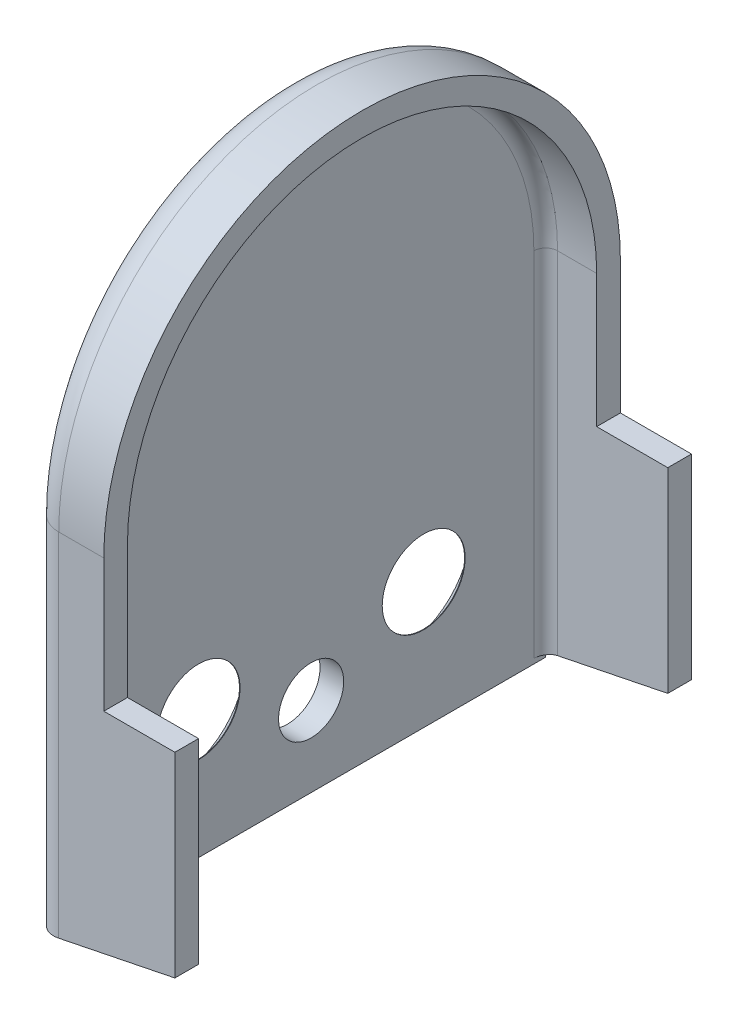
ISO-10303-21;
HEADER;
FILE_DESCRIPTION(('STEP AP214'),'2;1');
FILE_NAME('part.step','',(''),(''),'','','');
FILE_SCHEMA(('AUTOMOTIVE_DESIGN { 1 0 10303 214 1 1 1 1 }'));
ENDSEC;
DATA;
#1=APPLICATION_CONTEXT('core data for automotive mechanical design processes');
#2=APPLICATION_PROTOCOL_DEFINITION('international standard','automotive_design',2000,#1);
#3=PRODUCT_CONTEXT('',#1,'mechanical');
#4=PRODUCT('Part','Part','',(#3));
#5=PRODUCT_RELATED_PRODUCT_CATEGORY('part','',(#4));
#6=PRODUCT_DEFINITION_FORMATION('','',#4);
#7=PRODUCT_DEFINITION_CONTEXT('part definition',#1,'design');
#8=PRODUCT_DEFINITION('design','',#6,#7);
#9=PRODUCT_DEFINITION_SHAPE('','',#8);
#10=(LENGTH_UNIT() NAMED_UNIT(*) SI_UNIT(.MILLI.,.METRE.));
#11=(NAMED_UNIT(*) PLANE_ANGLE_UNIT() SI_UNIT($,.RADIAN.));
#12=(NAMED_UNIT(*) SI_UNIT($,.STERADIAN.) SOLID_ANGLE_UNIT());
#13=UNCERTAINTY_MEASURE_WITH_UNIT(LENGTH_MEASURE(1.E-05),#10,'distance_accuracy_value','');
#14=(GEOMETRIC_REPRESENTATION_CONTEXT(3) GLOBAL_UNCERTAINTY_ASSIGNED_CONTEXT((#13)) GLOBAL_UNIT_ASSIGNED_CONTEXT((#10,
#11,#12)) REPRESENTATION_CONTEXT('',''));
#15=CARTESIAN_POINT('',(0.,0.,0.));
#16=DIRECTION('',(0.,0.,1.));
#17=DIRECTION('',(1.,0.,0.));
#18=AXIS2_PLACEMENT_3D('',#15,#16,#17);
#19=CARTESIAN_POINT('',(-2.,-26.,21.8));
#20=DIRECTION('',(0.,-1.,0.));
#21=DIRECTION('',(0.,0.,-1.));
#22=AXIS2_PLACEMENT_3D('',#19,#20,#21);
#23=PLANE('',#22);
#24=DIRECTION('',(0.,0.,-1.));
#25=VECTOR('',#24,1.);
#26=CARTESIAN_POINT('',(-2.,-26.,21.8));
#27=LINE('',#26,#25);
#28=CARTESIAN_POINT('',(-2.,-26.,19.3));
#29=VERTEX_POINT('',#28);
#30=CARTESIAN_POINT('',(-2.,-26.,-19.3));
#31=VERTEX_POINT('',#30);
#32=EDGE_CURVE('E247',#29,#31,#27,.T.);
#33=ORIENTED_EDGE('',*,*,#32,.T.);
#34=CARTESIAN_POINT('',(0.5,-26.,-19.3));
#35=DIRECTION('',(0.,-1.,0.));
#36=DIRECTION('',(0.,0.,-1.));
#37=AXIS2_PLACEMENT_3D('',#34,#35,#36);
#38=CIRCLE('',#37,2.5);
#39=CARTESIAN_POINT('',(-1.94948974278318,-26.,-19.8));
#40=VERTEX_POINT('',#39);
#41=EDGE_CURVE('E428',#31,#40,#38,.T.);
#42=ORIENTED_EDGE('',*,*,#41,.T.);
#43=DIRECTION('',(1.,0.,0.));
#44=VECTOR('',#43,1.);
#45=CARTESIAN_POINT('',(10.3,-26.,-19.8));
#46=LINE('',#45,#44);
#47=CARTESIAN_POINT('',(0.,-26.,-19.8));
#48=VERTEX_POINT('',#47);
#49=EDGE_CURVE('E254',#40,#48,#46,.T.);
#50=ORIENTED_EDGE('',*,*,#49,.T.);
#51=DIRECTION('',(0.,0.,-1.));
#52=VECTOR('',#51,1.);
#53=CARTESIAN_POINT('',(0.,-26.,21.8));
#54=LINE('',#53,#52);
#55=CARTESIAN_POINT('',(0.,-26.,19.8));
#56=VERTEX_POINT('',#55);
#57=EDGE_CURVE('E307',#56,#48,#54,.T.);
#58=ORIENTED_EDGE('',*,*,#57,.F.);
#59=DIRECTION('',(1.,0.,0.));
#60=VECTOR('',#59,1.);
#61=CARTESIAN_POINT('',(10.3,-26.,19.8));
#62=LINE('',#61,#60);
#63=CARTESIAN_POINT('',(-1.94948974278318,-26.,19.8));
#64=VERTEX_POINT('',#63);
#65=EDGE_CURVE('E257',#64,#56,#62,.T.);
#66=ORIENTED_EDGE('',*,*,#65,.F.);
#67=CARTESIAN_POINT('',(0.5,-26.,19.3));
#68=DIRECTION('',(0.,-1.,0.));
#69=DIRECTION('',(0.,0.,-1.));
#70=AXIS2_PLACEMENT_3D('',#67,#68,#69);
#71=CIRCLE('',#70,2.5);
#72=EDGE_CURVE('E253',#64,#29,#71,.T.);
#73=ORIENTED_EDGE('',*,*,#72,.T.);
#74=EDGE_LOOP('',(#33,#42,#50,#58,#66,#73));
#75=FACE_BOUND('',#74,.T.);
#76=ADVANCED_FACE('F36',(#75),#23,.T.);
#77=CARTESIAN_POINT('',(-2.,-26.,-21.8));
#78=DIRECTION('',(0.,0.,-1.));
#79=DIRECTION('',(-1.,0.,0.));
#80=AXIS2_PLACEMENT_3D('',#77,#78,#79);
#81=PLANE('',#80);
#82=DIRECTION('',(-0.979963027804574,-0.199179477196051,0.));
#83=VECTOR('',#82,1.);
#84=CARTESIAN_POINT('',(-2.,-26.,-21.8));
#85=LINE('',#84,#83);
#86=CARTESIAN_POINT('',(10.3,-23.5,-21.8));
#87=VERTEX_POINT('',#86);
#88=CARTESIAN_POINT('',(0.5,-25.4918699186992,-21.8));
#89=VERTEX_POINT('',#88);
#90=EDGE_CURVE('E178',#87,#89,#85,.T.);
#91=ORIENTED_EDGE('',*,*,#90,.T.);
#92=DIRECTION('',(0.,1.,0.));
#93=VECTOR('',#92,1.);
#94=CARTESIAN_POINT('',(0.5,-26.,-21.8));
#95=LINE('',#94,#93);
#96=CARTESIAN_POINT('',(0.5,4.2,-21.8));
#97=VERTEX_POINT('',#96);
#98=EDGE_CURVE('E243',#89,#97,#95,.T.);
#99=ORIENTED_EDGE('',*,*,#98,.T.);
#100=DIRECTION('',(1.,0.,0.));
#101=VECTOR('',#100,1.);
#102=CARTESIAN_POINT('',(0.,4.2,-21.8));
#103=LINE('',#102,#101);
#104=CARTESIAN_POINT('',(4.3,4.2,-21.8));
#105=VERTEX_POINT('',#104);
#106=EDGE_CURVE('E301',#105,#97,#103,.F.);
#107=ORIENTED_EDGE('',*,*,#106,.F.);
#108=DIRECTION('',(0.,1.,0.));
#109=VECTOR('',#108,1.);
#110=CARTESIAN_POINT('',(4.3,-26.,-21.8));
#111=LINE('',#110,#109);
#112=CARTESIAN_POINT('',(4.3,-7.,-21.8));
#113=VERTEX_POINT('',#112);
#114=EDGE_CURVE('E291',#113,#105,#111,.T.);
#115=ORIENTED_EDGE('',*,*,#114,.F.);
#116=DIRECTION('',(-1.,0.,0.));
#117=VECTOR('',#116,1.);
#118=CARTESIAN_POINT('',(10.3,-7.,-21.8));
#119=LINE('',#118,#117);
#120=CARTESIAN_POINT('',(10.3,-7.,-21.8));
#121=VERTEX_POINT('',#120);
#122=EDGE_CURVE('E202',#121,#113,#119,.T.);
#123=ORIENTED_EDGE('',*,*,#122,.F.);
#124=DIRECTION('',(0.,-1.,0.));
#125=VECTOR('',#124,1.);
#126=CARTESIAN_POINT('',(10.3,-7.,-21.8));
#127=LINE('',#126,#125);
#128=EDGE_CURVE('E204',#121,#87,#127,.T.);
#129=ORIENTED_EDGE('',*,*,#128,.T.);
#130=EDGE_LOOP('',(#91,#99,#107,#115,#123,#129));
#131=FACE_BOUND('',#130,.T.);
#132=ADVANCED_FACE('F279',(#131),#81,.T.);
#133=CARTESIAN_POINT('',(4.3,-26.,-19.8));
#134=DIRECTION('',(0.,0.,-1.));
#135=DIRECTION('',(-1.,0.,0.));
#136=AXIS2_PLACEMENT_3D('',#133,#134,#135);
#137=PLANE('',#136);
#138=DIRECTION('',(-1.,0.,0.));
#139=VECTOR('',#138,1.);
#140=CARTESIAN_POINT('',(4.3,4.2,-19.8));
#141=LINE('',#140,#139);
#142=CARTESIAN_POINT('',(4.3,4.2,-19.8));
#143=VERTEX_POINT('',#142);
#144=CARTESIAN_POINT('',(1.,4.2,-19.8));
#145=VERTEX_POINT('',#144);
#146=EDGE_CURVE('E288',#143,#145,#141,.T.);
#147=ORIENTED_EDGE('',*,*,#146,.T.);
#148=DIRECTION('',(0.,-1.,0.));
#149=VECTOR('',#148,1.);
#150=CARTESIAN_POINT('',(1.,-25.5934959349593,-19.8));
#151=LINE('',#150,#149);
#152=CARTESIAN_POINT('',(1.,-25.390243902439,-19.8));
#153=VERTEX_POINT('',#152);
#154=EDGE_CURVE('E193',#145,#153,#151,.T.);
#155=ORIENTED_EDGE('',*,*,#154,.T.);
#156=DIRECTION('',(-0.979963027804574,-0.199179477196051,0.));
#157=VECTOR('',#156,1.);
#158=CARTESIAN_POINT('',(-2.,-26.,-19.8));
#159=LINE('',#158,#157);
#160=CARTESIAN_POINT('',(10.3,-23.5,-19.8));
#161=VERTEX_POINT('',#160);
#162=EDGE_CURVE('E176',#161,#153,#159,.T.);
#163=ORIENTED_EDGE('',*,*,#162,.F.);
#164=DIRECTION('',(0.,1.,0.));
#165=VECTOR('',#164,1.);
#166=CARTESIAN_POINT('',(10.3,-26.,-19.8));
#167=LINE('',#166,#165);
#168=CARTESIAN_POINT('',(10.3,-7.,-19.8));
#169=VERTEX_POINT('',#168);
#170=EDGE_CURVE('E190',#161,#169,#167,.T.);
#171=ORIENTED_EDGE('',*,*,#170,.T.);
#172=DIRECTION('',(-1.,0.,0.));
#173=VECTOR('',#172,1.);
#174=CARTESIAN_POINT('',(10.3,-7.,-19.8));
#175=LINE('',#174,#173);
#176=CARTESIAN_POINT('',(4.3,-7.,-19.8));
#177=VERTEX_POINT('',#176);
#178=EDGE_CURVE('E200',#169,#177,#175,.T.);
#179=ORIENTED_EDGE('',*,*,#178,.T.);
#180=DIRECTION('',(0.,-1.,0.));
#181=VECTOR('',#180,1.);
#182=CARTESIAN_POINT('',(4.3,-26.,-19.8));
#183=LINE('',#182,#181);
#184=EDGE_CURVE('E286',#143,#177,#183,.T.);
#185=ORIENTED_EDGE('',*,*,#184,.F.);
#186=EDGE_LOOP('',(#147,#155,#163,#171,#179,#185));
#187=FACE_BOUND('',#186,.T.);
#188=ADVANCED_FACE('F188',(#187),#137,.F.);
#189=CARTESIAN_POINT('',(10.3,0.,0.));
#190=DIRECTION('',(1.,0.,0.));
#191=DIRECTION('',(0.,0.,1.));
#192=AXIS2_PLACEMENT_3D('',#189,#190,#191);
#193=PLANE('',#192);
#194=ORIENTED_EDGE('',*,*,#170,.F.);
#195=DIRECTION('',(0.,0.,-1.));
#196=VECTOR('',#195,1.);
#197=CARTESIAN_POINT('',(10.3,-23.5,-19.8));
#198=LINE('',#197,#196);
#199=EDGE_CURVE('E173',#161,#87,#198,.T.);
#200=ORIENTED_EDGE('',*,*,#199,.T.);
#201=ORIENTED_EDGE('',*,*,#128,.F.);
#202=DIRECTION('',(0.,0.,-1.));
#203=VECTOR('',#202,1.);
#204=CARTESIAN_POINT('',(10.3,-7.,-19.8));
#205=LINE('',#204,#203);
#206=EDGE_CURVE('E199',#169,#121,#205,.T.);
#207=ORIENTED_EDGE('',*,*,#206,.F.);
#208=EDGE_LOOP('',(#194,#200,#201,#207));
#209=FACE_BOUND('',#208,.T.);
#210=ADVANCED_FACE('F197',(#209),#193,.T.);
#211=CARTESIAN_POINT('',(0.,0.,0.));
#212=DIRECTION('',(-1.,0.,0.));
#213=DIRECTION('',(0.,0.,1.));
#214=AXIS2_PLACEMENT_3D('',#211,#212,#213);
#215=PLANE('',#214);
#216=CARTESIAN_POINT('',(0.,-15.3449348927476,9.5));
#217=DIRECTION('',(-1.,0.,0.));
#218=DIRECTION('',(0.,0.,1.));
#219=AXIS2_PLACEMENT_3D('',#216,#217,#218);
#220=CIRCLE('',#219,3.5);
#221=CARTESIAN_POINT('',(0.,-15.3449348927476,13.));
#222=VERTEX_POINT('',#221);
#223=EDGE_CURVE('E393',#222,#222,#220,.T.);
#224=ORIENTED_EDGE('',*,*,#223,.T.);
#225=EDGE_LOOP('',(#224));
#226=FACE_BOUND('',#225,.T.);
#227=CARTESIAN_POINT('',(0.,-15.3449348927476,-9.5));
#228=DIRECTION('',(-1.,0.,0.));
#229=DIRECTION('',(0.,0.,1.));
#230=AXIS2_PLACEMENT_3D('',#227,#228,#229);
#231=CIRCLE('',#230,3.5);
#232=CARTESIAN_POINT('',(0.,-15.3449348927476,-6.));
#233=VERTEX_POINT('',#232);
#234=EDGE_CURVE('E395',#233,#233,#231,.T.);
#235=ORIENTED_EDGE('',*,*,#234,.T.);
#236=EDGE_LOOP('',(#235));
#237=FACE_BOUND('',#236,.T.);
#238=CARTESIAN_POINT('',(0.,-19.25,0.));
#239=DIRECTION('',(1.,0.,0.));
#240=DIRECTION('',(0.,0.,-1.));
#241=AXIS2_PLACEMENT_3D('',#238,#239,#240);
#242=CIRCLE('',#241,2.75);
#243=CARTESIAN_POINT('',(0.,-19.25,-2.75));
#244=VERTEX_POINT('',#243);
#245=EDGE_CURVE('E262',#244,#244,#242,.T.);
#246=ORIENTED_EDGE('',*,*,#245,.F.);
#247=EDGE_LOOP('',(#246));
#248=FACE_BOUND('',#247,.T.);
#249=DIRECTION('',(0.,-1.,0.));
#250=VECTOR('',#249,1.);
#251=CARTESIAN_POINT('',(0.,0.,-19.8));
#252=LINE('',#251,#250);
#253=CARTESIAN_POINT('',(0.,-25.5934959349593,-19.8));
#254=VERTEX_POINT('',#253);
#255=EDGE_CURVE('E183',#254,#48,#252,.T.);
#256=ORIENTED_EDGE('',*,*,#255,.F.);
#257=DIRECTION('',(0.,0.,1.));
#258=VECTOR('',#257,1.);
#259=CARTESIAN_POINT('',(0.,-25.5934959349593,0.));
#260=LINE('',#259,#258);
#261=CARTESIAN_POINT('',(0.,-25.5934959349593,-18.8));
#262=VERTEX_POINT('',#261);
#263=EDGE_CURVE('E51',#254,#262,#260,.T.);
#264=ORIENTED_EDGE('',*,*,#263,.T.);
#265=DIRECTION('',(0.,-1.,0.));
#266=VECTOR('',#265,1.);
#267=CARTESIAN_POINT('',(0.,4.2,-18.8));
#268=LINE('',#267,#266);
#269=CARTESIAN_POINT('',(0.,4.2,-18.8));
#270=VERTEX_POINT('',#269);
#271=EDGE_CURVE('E357',#262,#270,#268,.F.);
#272=ORIENTED_EDGE('',*,*,#271,.T.);
#273=CARTESIAN_POINT('',(0.,4.2,0.));
#274=DIRECTION('',(-1.,0.,0.));
#275=DIRECTION('',(0.,0.,1.));
#276=AXIS2_PLACEMENT_3D('',#273,#274,#275);
#277=CIRCLE('',#276,18.8);
#278=CARTESIAN_POINT('',(0.,4.2,18.8));
#279=VERTEX_POINT('',#278);
#280=EDGE_CURVE('E446',#270,#279,#277,.F.);
#281=ORIENTED_EDGE('',*,*,#280,.T.);
#282=DIRECTION('',(0.,1.,0.));
#283=VECTOR('',#282,1.);
#284=CARTESIAN_POINT('',(0.,-25.5934959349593,18.8));
#285=LINE('',#284,#283);
#286=CARTESIAN_POINT('',(0.,-25.5934959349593,18.8));
#287=VERTEX_POINT('',#286);
#288=EDGE_CURVE('E443',#279,#287,#285,.F.);
#289=ORIENTED_EDGE('',*,*,#288,.T.);
#290=DIRECTION('',(0.,0.,1.));
#291=VECTOR('',#290,1.);
#292=CARTESIAN_POINT('',(0.,-25.5934959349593,19.8));
#293=LINE('',#292,#291);
#294=CARTESIAN_POINT('',(0.,-25.5934959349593,19.8));
#295=VERTEX_POINT('',#294);
#296=EDGE_CURVE('E441',#287,#295,#293,.T.);
#297=ORIENTED_EDGE('',*,*,#296,.T.);
#298=DIRECTION('',(0.,1.,0.));
#299=VECTOR('',#298,1.);
#300=CARTESIAN_POINT('',(0.,4.2,19.8));
#301=LINE('',#300,#299);
#302=EDGE_CURVE('E240',#56,#295,#301,.T.);
#303=ORIENTED_EDGE('',*,*,#302,.F.);
#304=ORIENTED_EDGE('',*,*,#57,.T.);
#305=EDGE_LOOP('',(#256,#264,#272,#281,#289,#297,#303,#304));
#306=FACE_BOUND('',#305,.T.);
#307=ADVANCED_FACE('F407',(#226,#237,#248,#306),#215,.F.);
#308=CARTESIAN_POINT('',(-2.,0.,0.));
#309=DIRECTION('',(-1.,0.,0.));
#310=DIRECTION('',(0.,0.,1.));
#311=AXIS2_PLACEMENT_3D('',#308,#309,#310);
#312=PLANE('',#311);
#313=CARTESIAN_POINT('',(-2.,-15.3449348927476,9.5));
#314=DIRECTION('',(-1.,0.,0.));
#315=DIRECTION('',(0.,0.,1.));
#316=AXIS2_PLACEMENT_3D('',#313,#314,#315);
#317=CIRCLE('',#316,6.00000000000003);
#318=CARTESIAN_POINT('',(-2.,-15.3449348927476,15.5));
#319=VERTEX_POINT('',#318);
#320=EDGE_CURVE('E44',#319,#319,#317,.F.);
#321=ORIENTED_EDGE('',*,*,#320,.T.);
#322=EDGE_LOOP('',(#321));
#323=FACE_BOUND('',#322,.T.);
#324=CARTESIAN_POINT('',(-2.,-15.3449348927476,-9.5));
#325=DIRECTION('',(-1.,0.,0.));
#326=DIRECTION('',(0.,0.,1.));
#327=AXIS2_PLACEMENT_3D('',#324,#325,#326);
#328=CIRCLE('',#327,6.00000000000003);
#329=CARTESIAN_POINT('',(-2.,-15.3449348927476,-3.49999999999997));
#330=VERTEX_POINT('',#329);
#331=EDGE_CURVE('E373',#330,#330,#328,.F.);
#332=ORIENTED_EDGE('',*,*,#331,.T.);
#333=EDGE_LOOP('',(#332));
#334=FACE_BOUND('',#333,.T.);
#335=CARTESIAN_POINT('',(-2.,-19.25,0.));
#336=DIRECTION('',(1.,0.,0.));
#337=DIRECTION('',(0.,0.,-1.));
#338=AXIS2_PLACEMENT_3D('',#335,#336,#337);
#339=CIRCLE('',#338,2.75);
#340=CARTESIAN_POINT('',(-2.,-19.25,-2.75));
#341=VERTEX_POINT('',#340);
#342=EDGE_CURVE('E368',#341,#341,#339,.T.);
#343=ORIENTED_EDGE('',*,*,#342,.T.);
#344=EDGE_LOOP('',(#343));
#345=FACE_BOUND('',#344,.T.);
#346=CARTESIAN_POINT('',(-2.,4.2,0.));
#347=DIRECTION('',(-1.,0.,0.));
#348=DIRECTION('',(0.,0.,1.));
#349=AXIS2_PLACEMENT_3D('',#346,#347,#348);
#350=CIRCLE('',#349,19.3);
#351=CARTESIAN_POINT('',(-2.,4.2,19.3));
#352=VERTEX_POINT('',#351);
#353=CARTESIAN_POINT('',(-2.,4.2,-19.3));
#354=VERTEX_POINT('',#353);
#355=EDGE_CURVE('E249',#352,#354,#350,.T.);
#356=ORIENTED_EDGE('',*,*,#355,.T.);
#357=DIRECTION('',(0.,1.,0.));
#358=VECTOR('',#357,1.);
#359=CARTESIAN_POINT('',(-2.,0.,-19.3));
#360=LINE('',#359,#358);
#361=EDGE_CURVE('E251',#354,#31,#360,.F.);
#362=ORIENTED_EDGE('',*,*,#361,.T.);
#363=ORIENTED_EDGE('',*,*,#32,.F.);
#364=DIRECTION('',(0.,-1.,0.));
#365=VECTOR('',#364,1.);
#366=CARTESIAN_POINT('',(-2.,0.,19.3));
#367=LINE('',#366,#365);
#368=EDGE_CURVE('E246',#29,#352,#367,.F.);
#369=ORIENTED_EDGE('',*,*,#368,.T.);
#370=EDGE_LOOP('',(#356,#362,#363,#369));
#371=FACE_BOUND('',#370,.T.);
#372=ADVANCED_FACE('F378',(#323,#334,#345,#371),#312,.T.);
#373=CARTESIAN_POINT('',(-2.,-26.,21.8));
#374=DIRECTION('',(0.,0.,1.));
#375=DIRECTION('',(1.,0.,0.));
#376=AXIS2_PLACEMENT_3D('',#373,#374,#375);
#377=PLANE('',#376);
#378=DIRECTION('',(1.,0.,0.));
#379=VECTOR('',#378,1.);
#380=CARTESIAN_POINT('',(0.,4.2,21.8));
#381=LINE('',#380,#379);
#382=CARTESIAN_POINT('',(4.3,4.2,21.8));
#383=VERTEX_POINT('',#382);
#384=CARTESIAN_POINT('',(0.5,4.2,21.8));
#385=VERTEX_POINT('',#384);
#386=EDGE_CURVE('E304',#383,#385,#381,.F.);
#387=ORIENTED_EDGE('',*,*,#386,.T.);
#388=DIRECTION('',(0.,-1.,0.));
#389=VECTOR('',#388,1.);
#390=CARTESIAN_POINT('',(0.5,-26.,21.8));
#391=LINE('',#390,#389);
#392=CARTESIAN_POINT('',(0.5,-25.4918699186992,21.8));
#393=VERTEX_POINT('',#392);
#394=EDGE_CURVE('E426',#385,#393,#391,.T.);
#395=ORIENTED_EDGE('',*,*,#394,.T.);
#396=DIRECTION('',(-0.979963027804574,-0.199179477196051,0.));
#397=VECTOR('',#396,1.);
#398=CARTESIAN_POINT('',(-2.,-26.,21.8));
#399=LINE('',#398,#397);
#400=CARTESIAN_POINT('',(10.3,-23.5,21.8));
#401=VERTEX_POINT('',#400);
#402=EDGE_CURVE('E269',#401,#393,#399,.T.);
#403=ORIENTED_EDGE('',*,*,#402,.F.);
#404=DIRECTION('',(0.,-1.,0.));
#405=VECTOR('',#404,1.);
#406=CARTESIAN_POINT('',(10.3,-7.,21.8));
#407=LINE('',#406,#405);
#408=CARTESIAN_POINT('',(10.3,-7.,21.8));
#409=VERTEX_POINT('',#408);
#410=EDGE_CURVE('E214',#409,#401,#407,.T.);
#411=ORIENTED_EDGE('',*,*,#410,.F.);
#412=DIRECTION('',(-1.,0.,0.));
#413=VECTOR('',#412,1.);
#414=CARTESIAN_POINT('',(10.3,-7.,21.8));
#415=LINE('',#414,#413);
#416=CARTESIAN_POINT('',(4.3,-7.,21.8));
#417=VERTEX_POINT('',#416);
#418=EDGE_CURVE('E221',#409,#417,#415,.T.);
#419=ORIENTED_EDGE('',*,*,#418,.T.);
#420=DIRECTION('',(0.,-1.,0.));
#421=VECTOR('',#420,1.);
#422=CARTESIAN_POINT('',(4.3,4.2,21.8));
#423=LINE('',#422,#421);
#424=EDGE_CURVE('E317',#383,#417,#423,.T.);
#425=ORIENTED_EDGE('',*,*,#424,.F.);
#426=EDGE_LOOP('',(#387,#395,#403,#411,#419,#425));
#427=FACE_BOUND('',#426,.T.);
#428=ADVANCED_FACE('F331',(#427),#377,.T.);
#429=CARTESIAN_POINT('',(0.,4.2,0.));
#430=DIRECTION('',(1.,0.,0.));
#431=DIRECTION('',(0.,0.,-1.));
#432=AXIS2_PLACEMENT_3D('',#429,#430,#431);
#433=CYLINDRICAL_SURFACE('',#432,21.8);
#434=ORIENTED_EDGE('',*,*,#106,.T.);
#435=CARTESIAN_POINT('',(0.5,4.2,0.));
#436=DIRECTION('',(-1.,0.,0.));
#437=DIRECTION('',(0.,0.,1.));
#438=AXIS2_PLACEMENT_3D('',#435,#436,#437);
#439=CIRCLE('',#438,21.8);
#440=EDGE_CURVE('E328',#97,#385,#439,.F.);
#441=ORIENTED_EDGE('',*,*,#440,.T.);
#442=ORIENTED_EDGE('',*,*,#386,.F.);
#443=CARTESIAN_POINT('',(4.3,4.2,0.));
#444=DIRECTION('',(1.,0.,0.));
#445=DIRECTION('',(0.,0.,-1.));
#446=AXIS2_PLACEMENT_3D('',#443,#444,#445);
#447=CIRCLE('',#446,21.8);
#448=EDGE_CURVE('E224',#105,#383,#447,.T.);
#449=ORIENTED_EDGE('',*,*,#448,.F.);
#450=EDGE_LOOP('',(#434,#441,#442,#449));
#451=FACE_BOUND('',#450,.T.);
#452=ADVANCED_FACE('F326',(#451),#433,.T.);
#453=CARTESIAN_POINT('',(4.3,4.2,19.8));
#454=DIRECTION('',(0.,0.,1.));
#455=DIRECTION('',(0.,-1.,0.));
#456=AXIS2_PLACEMENT_3D('',#453,#454,#455);
#457=PLANE('',#456);
#458=DIRECTION('',(-0.979963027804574,-0.199179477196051,0.));
#459=VECTOR('',#458,1.);
#460=CARTESIAN_POINT('',(-2.,-26.,19.8));
#461=LINE('',#460,#459);
#462=CARTESIAN_POINT('',(10.3,-23.5,19.8));
#463=VERTEX_POINT('',#462);
#464=CARTESIAN_POINT('',(1.,-25.390243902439,19.8));
#465=VERTEX_POINT('',#464);
#466=EDGE_CURVE('E273',#463,#465,#461,.T.);
#467=ORIENTED_EDGE('',*,*,#466,.T.);
#468=DIRECTION('',(0.,1.,0.));
#469=VECTOR('',#468,1.);
#470=CARTESIAN_POINT('',(1.,4.2,19.8));
#471=LINE('',#470,#469);
#472=CARTESIAN_POINT('',(1.,4.2,19.8));
#473=VERTEX_POINT('',#472);
#474=EDGE_CURVE('E346',#465,#473,#471,.T.);
#475=ORIENTED_EDGE('',*,*,#474,.T.);
#476=DIRECTION('',(-1.,0.,0.));
#477=VECTOR('',#476,1.);
#478=CARTESIAN_POINT('',(4.3,4.2,19.8));
#479=LINE('',#478,#477);
#480=CARTESIAN_POINT('',(4.3,4.2,19.8));
#481=VERTEX_POINT('',#480);
#482=EDGE_CURVE('E298',#481,#473,#479,.T.);
#483=ORIENTED_EDGE('',*,*,#482,.F.);
#484=DIRECTION('',(0.,1.,0.));
#485=VECTOR('',#484,1.);
#486=CARTESIAN_POINT('',(4.3,4.2,19.8));
#487=LINE('',#486,#485);
#488=CARTESIAN_POINT('',(4.3,-6.99999999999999,19.8));
#489=VERTEX_POINT('',#488);
#490=EDGE_CURVE('E230',#489,#481,#487,.T.);
#491=ORIENTED_EDGE('',*,*,#490,.F.);
#492=DIRECTION('',(-1.,0.,0.));
#493=VECTOR('',#492,1.);
#494=CARTESIAN_POINT('',(10.3,-7.,19.8));
#495=LINE('',#494,#493);
#496=CARTESIAN_POINT('',(10.3,-7.,19.8));
#497=VERTEX_POINT('',#496);
#498=EDGE_CURVE('E235',#497,#489,#495,.T.);
#499=ORIENTED_EDGE('',*,*,#498,.F.);
#500=DIRECTION('',(0.,1.,0.));
#501=VECTOR('',#500,1.);
#502=CARTESIAN_POINT('',(10.3,-26.,19.8));
#503=LINE('',#502,#501);
#504=EDGE_CURVE('E217',#463,#497,#503,.T.);
#505=ORIENTED_EDGE('',*,*,#504,.F.);
#506=EDGE_LOOP('',(#467,#475,#483,#491,#499,#505));
#507=FACE_BOUND('',#506,.T.);
#508=ADVANCED_FACE('F342',(#507),#457,.F.);
#509=CARTESIAN_POINT('',(4.3,4.2,0.));
#510=DIRECTION('',(-1.,0.,0.));
#511=DIRECTION('',(0.,0.,1.));
#512=AXIS2_PLACEMENT_3D('',#509,#510,#511);
#513=CYLINDRICAL_SURFACE('',#512,19.8);
#514=ORIENTED_EDGE('',*,*,#482,.T.);
#515=CARTESIAN_POINT('',(1.,4.2,0.));
#516=DIRECTION('',(-1.,0.,0.));
#517=DIRECTION('',(0.,0.,1.));
#518=AXIS2_PLACEMENT_3D('',#515,#516,#517);
#519=CIRCLE('',#518,19.8);
#520=EDGE_CURVE('E351',#473,#145,#519,.T.);
#521=ORIENTED_EDGE('',*,*,#520,.T.);
#522=ORIENTED_EDGE('',*,*,#146,.F.);
#523=CARTESIAN_POINT('',(4.3,4.2,0.));
#524=DIRECTION('',(-1.,0.,0.));
#525=DIRECTION('',(0.,0.,-1.));
#526=AXIS2_PLACEMENT_3D('',#523,#524,#525);
#527=CIRCLE('',#526,19.8);
#528=EDGE_CURVE('E292',#481,#143,#527,.T.);
#529=ORIENTED_EDGE('',*,*,#528,.F.);
#530=EDGE_LOOP('',(#514,#521,#522,#529));
#531=FACE_BOUND('',#530,.T.);
#532=ADVANCED_FACE('F349',(#531),#513,.F.);
#533=CARTESIAN_POINT('',(4.3,4.2,0.));
#534=DIRECTION('',(1.,0.,0.));
#535=DIRECTION('',(0.,0.,-1.));
#536=AXIS2_PLACEMENT_3D('',#533,#534,#535);
#537=PLANE('',#536);
#538=DIRECTION('',(0.,0.,-1.));
#539=VECTOR('',#538,1.);
#540=CARTESIAN_POINT('',(4.3,-7.,-19.8));
#541=LINE('',#540,#539);
#542=EDGE_CURVE('E208',#177,#113,#541,.T.);
#543=ORIENTED_EDGE('',*,*,#542,.T.);
#544=ORIENTED_EDGE('',*,*,#114,.T.);
#545=ORIENTED_EDGE('',*,*,#448,.T.);
#546=ORIENTED_EDGE('',*,*,#424,.T.);
#547=DIRECTION('',(0.,0.,1.));
#548=VECTOR('',#547,1.);
#549=CARTESIAN_POINT('',(4.3,-7.,19.8));
#550=LINE('',#549,#548);
#551=EDGE_CURVE('E213',#489,#417,#550,.T.);
#552=ORIENTED_EDGE('',*,*,#551,.F.);
#553=ORIENTED_EDGE('',*,*,#490,.T.);
#554=ORIENTED_EDGE('',*,*,#528,.T.);
#555=ORIENTED_EDGE('',*,*,#184,.T.);
#556=EDGE_LOOP('',(#543,#544,#545,#546,#552,#553,#554,#555));
#557=FACE_BOUND('',#556,.T.);
#558=ADVANCED_FACE('F323',(#557),#537,.T.);
#559=CARTESIAN_POINT('',(10.3,-7.,19.8));
#560=DIRECTION('',(0.,-1.,0.));
#561=DIRECTION('',(0.,0.,-1.));
#562=AXIS2_PLACEMENT_3D('',#559,#560,#561);
#563=PLANE('',#562);
#564=ORIENTED_EDGE('',*,*,#551,.T.);
#565=ORIENTED_EDGE('',*,*,#418,.F.);
#566=DIRECTION('',(0.,0.,1.));
#567=VECTOR('',#566,1.);
#568=CARTESIAN_POINT('',(10.3,-7.,19.8));
#569=LINE('',#568,#567);
#570=EDGE_CURVE('E219',#497,#409,#569,.T.);
#571=ORIENTED_EDGE('',*,*,#570,.F.);
#572=ORIENTED_EDGE('',*,*,#498,.T.);
#573=EDGE_LOOP('',(#564,#565,#571,#572));
#574=FACE_BOUND('',#573,.T.);
#575=ADVANCED_FACE('F337',(#574),#563,.F.);
#576=CARTESIAN_POINT('',(10.3,0.,0.));
#577=DIRECTION('',(1.,0.,0.));
#578=DIRECTION('',(0.,0.,-1.));
#579=AXIS2_PLACEMENT_3D('',#576,#577,#578);
#580=PLANE('',#579);
#581=DIRECTION('',(0.,0.,1.));
#582=VECTOR('',#581,1.);
#583=CARTESIAN_POINT('',(10.3,-23.5,19.8));
#584=LINE('',#583,#582);
#585=EDGE_CURVE('E209',#463,#401,#584,.T.);
#586=ORIENTED_EDGE('',*,*,#585,.F.);
#587=ORIENTED_EDGE('',*,*,#504,.T.);
#588=ORIENTED_EDGE('',*,*,#570,.T.);
#589=ORIENTED_EDGE('',*,*,#410,.T.);
#590=EDGE_LOOP('',(#586,#587,#588,#589));
#591=FACE_BOUND('',#590,.T.);
#592=ADVANCED_FACE('F518',(#591),#580,.T.);
#593=CARTESIAN_POINT('',(10.3,-7.,-19.8));
#594=DIRECTION('',(0.,1.,0.));
#595=DIRECTION('',(0.,0.,1.));
#596=AXIS2_PLACEMENT_3D('',#593,#594,#595);
#597=PLANE('',#596);
#598=ORIENTED_EDGE('',*,*,#542,.F.);
#599=ORIENTED_EDGE('',*,*,#178,.F.);
#600=ORIENTED_EDGE('',*,*,#206,.T.);
#601=ORIENTED_EDGE('',*,*,#122,.T.);
#602=EDGE_LOOP('',(#598,#599,#600,#601));
#603=FACE_BOUND('',#602,.T.);
#604=ADVANCED_FACE('F284',(#603),#597,.T.);
#605=CARTESIAN_POINT('',(0.,0.,19.8));
#606=DIRECTION('',(0.,0.,1.));
#607=DIRECTION('',(1.,0.,0.));
#608=AXIS2_PLACEMENT_3D('',#605,#606,#607);
#609=PLANE('',#608);
#610=CARTESIAN_POINT('',(-1.94948974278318,-25.9897336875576,19.8));
#611=VERTEX_POINT('',#610);
#612=EDGE_CURVE('E275',#295,#611,#461,.T.);
#613=ORIENTED_EDGE('',*,*,#612,.T.);
#614=DIRECTION('',(0.,-1.,0.));
#615=VECTOR('',#614,1.);
#616=CARTESIAN_POINT('',(-1.94948974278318,-25.9897336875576,19.8));
#617=LINE('',#616,#615);
#618=EDGE_CURVE('E435',#611,#64,#617,.T.);
#619=ORIENTED_EDGE('',*,*,#618,.T.);
#620=ORIENTED_EDGE('',*,*,#65,.T.);
#621=ORIENTED_EDGE('',*,*,#302,.T.);
#622=EDGE_LOOP('',(#613,#619,#620,#621));
#623=FACE_BOUND('',#622,.T.);
#624=ADVANCED_FACE('F494',(#623),#609,.T.);
#625=CARTESIAN_POINT('',(-2.,-26.,19.8));
#626=DIRECTION('',(-0.199179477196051,0.979963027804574,0.));
#627=DIRECTION('',(-0.979963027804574,-0.199179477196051,0.));
#628=AXIS2_PLACEMENT_3D('',#625,#626,#627);
#629=PLANE('',#628);
#630=ORIENTED_EDGE('',*,*,#402,.T.);
#631=CARTESIAN_POINT('',(0.5,-25.4918699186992,19.3));
#632=DIRECTION('',(-0.199179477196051,0.979963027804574,0.));
#633=DIRECTION('',(-0.979963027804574,-0.199179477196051,0.));
#634=AXIS2_PLACEMENT_3D('',#631,#632,#633);
#635=ELLIPSE('',#634,2.55111665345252,2.5);
#636=EDGE_CURVE('E433',#393,#611,#635,.F.);
#637=ORIENTED_EDGE('',*,*,#636,.T.);
#638=ORIENTED_EDGE('',*,*,#612,.F.);
#639=ORIENTED_EDGE('',*,*,#296,.F.);
#640=CARTESIAN_POINT('',(1.,-25.390243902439,18.8));
#641=DIRECTION('',(-0.199179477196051,0.979963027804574,0.));
#642=DIRECTION('',(-0.979963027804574,-0.199179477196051,0.));
#643=AXIS2_PLACEMENT_3D('',#640,#641,#642);
#644=ELLIPSE('',#643,1.02044666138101,1.);
#645=EDGE_CURVE('E59',#287,#465,#644,.T.);
#646=ORIENTED_EDGE('',*,*,#645,.T.);
#647=ORIENTED_EDGE('',*,*,#466,.F.);
#648=ORIENTED_EDGE('',*,*,#585,.T.);
#649=EDGE_LOOP('',(#630,#637,#638,#639,#646,#647,#648));
#650=FACE_BOUND('',#649,.T.);
#651=ADVANCED_FACE('F492',(#650),#629,.F.);
#652=CARTESIAN_POINT('',(0.,0.,-19.8));
#653=DIRECTION('',(0.,0.,-1.));
#654=DIRECTION('',(1.,0.,0.));
#655=AXIS2_PLACEMENT_3D('',#652,#653,#654);
#656=PLANE('',#655);
#657=ORIENTED_EDGE('',*,*,#49,.F.);
#658=DIRECTION('',(0.,1.,0.));
#659=VECTOR('',#658,1.);
#660=CARTESIAN_POINT('',(-1.94948974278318,-26.,-19.8));
#661=LINE('',#660,#659);
#662=CARTESIAN_POINT('',(-1.94948974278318,-25.9897336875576,-19.8));
#663=VERTEX_POINT('',#662);
#664=EDGE_CURVE('E419',#40,#663,#661,.T.);
#665=ORIENTED_EDGE('',*,*,#664,.T.);
#666=EDGE_CURVE('E194',#254,#663,#159,.T.);
#667=ORIENTED_EDGE('',*,*,#666,.F.);
#668=ORIENTED_EDGE('',*,*,#255,.T.);
#669=EDGE_LOOP('',(#657,#665,#667,#668));
#670=FACE_BOUND('',#669,.T.);
#671=ADVANCED_FACE('F417',(#670),#656,.T.);
#672=CARTESIAN_POINT('',(-2.,-26.,-19.8));
#673=DIRECTION('',(0.199179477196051,-0.979963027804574,0.));
#674=DIRECTION('',(0.979963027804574,0.199179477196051,0.));
#675=AXIS2_PLACEMENT_3D('',#672,#673,#674);
#676=PLANE('',#675);
#677=ORIENTED_EDGE('',*,*,#666,.T.);
#678=CARTESIAN_POINT('',(0.5,-25.4918699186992,-19.3));
#679=DIRECTION('',(0.199179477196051,-0.979963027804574,0.));
#680=DIRECTION('',(0.979963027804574,0.199179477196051,0.));
#681=AXIS2_PLACEMENT_3D('',#678,#679,#680);
#682=ELLIPSE('',#681,2.55111665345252,2.5);
#683=EDGE_CURVE('E421',#663,#89,#682,.T.);
#684=ORIENTED_EDGE('',*,*,#683,.T.);
#685=ORIENTED_EDGE('',*,*,#90,.F.);
#686=ORIENTED_EDGE('',*,*,#199,.F.);
#687=ORIENTED_EDGE('',*,*,#162,.T.);
#688=CARTESIAN_POINT('',(1.,-25.390243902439,-18.8));
#689=DIRECTION('',(0.199179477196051,-0.979963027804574,0.));
#690=DIRECTION('',(0.979963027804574,0.199179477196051,0.));
#691=AXIS2_PLACEMENT_3D('',#688,#689,#690);
#692=ELLIPSE('',#691,1.02044666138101,1.);
#693=EDGE_CURVE('E355',#153,#262,#692,.F.);
#694=ORIENTED_EDGE('',*,*,#693,.T.);
#695=ORIENTED_EDGE('',*,*,#263,.F.);
#696=EDGE_LOOP('',(#677,#684,#685,#686,#687,#694,#695));
#697=FACE_BOUND('',#696,.T.);
#698=ADVANCED_FACE('F175',(#697),#676,.T.);
#699=CARTESIAN_POINT('',(0.5,-26.,19.3));
#700=DIRECTION('',(0.,-1.,0.));
#701=DIRECTION('',(0.,0.,-1.));
#702=AXIS2_PLACEMENT_3D('',#699,#700,#701);
#703=CYLINDRICAL_SURFACE('',#702,2.5);
#704=ORIENTED_EDGE('',*,*,#636,.F.);
#705=ORIENTED_EDGE('',*,*,#394,.F.);
#706=CARTESIAN_POINT('',(0.5,4.2,19.3));
#707=DIRECTION('',(0.,1.,0.));
#708=DIRECTION('',(0.,0.,1.));
#709=AXIS2_PLACEMENT_3D('',#706,#707,#708);
#710=CIRCLE('',#709,2.5);
#711=EDGE_CURVE('E265',#352,#385,#710,.T.);
#712=ORIENTED_EDGE('',*,*,#711,.F.);
#713=ORIENTED_EDGE('',*,*,#368,.F.);
#714=ORIENTED_EDGE('',*,*,#72,.F.);
#715=ORIENTED_EDGE('',*,*,#618,.F.);
#716=EDGE_LOOP('',(#704,#705,#712,#713,#714,#715));
#717=FACE_BOUND('',#716,.T.);
#718=ADVANCED_FACE('F478',(#717),#703,.T.);
#719=CARTESIAN_POINT('',(0.5,4.2,0.));
#720=DIRECTION('',(-1.,0.,0.));
#721=DIRECTION('',(0.,0.,1.));
#722=AXIS2_PLACEMENT_3D('',#719,#720,#721);
#723=TOROIDAL_SURFACE('',#722,19.3,2.5);
#724=ORIENTED_EDGE('',*,*,#711,.T.);
#725=ORIENTED_EDGE('',*,*,#440,.F.);
#726=CARTESIAN_POINT('',(0.5,4.2,-19.3));
#727=DIRECTION('',(0.,-1.,0.));
#728=DIRECTION('',(0.,0.,-1.));
#729=AXIS2_PLACEMENT_3D('',#726,#727,#728);
#730=CIRCLE('',#729,2.5);
#731=EDGE_CURVE('E370',#354,#97,#730,.T.);
#732=ORIENTED_EDGE('',*,*,#731,.F.);
#733=ORIENTED_EDGE('',*,*,#355,.F.);
#734=EDGE_LOOP('',(#724,#725,#732,#733));
#735=FACE_BOUND('',#734,.T.);
#736=ADVANCED_FACE('F476',(#735),#723,.T.);
#737=CARTESIAN_POINT('',(0.5,-26.,-19.3));
#738=DIRECTION('',(0.,1.,0.));
#739=DIRECTION('',(0.,0.,1.));
#740=AXIS2_PLACEMENT_3D('',#737,#738,#739);
#741=CYLINDRICAL_SURFACE('',#740,2.5);
#742=ORIENTED_EDGE('',*,*,#41,.F.);
#743=ORIENTED_EDGE('',*,*,#361,.F.);
#744=ORIENTED_EDGE('',*,*,#731,.T.);
#745=ORIENTED_EDGE('',*,*,#98,.F.);
#746=ORIENTED_EDGE('',*,*,#683,.F.);
#747=ORIENTED_EDGE('',*,*,#664,.F.);
#748=EDGE_LOOP('',(#742,#743,#744,#745,#746,#747));
#749=FACE_BOUND('',#748,.T.);
#750=ADVANCED_FACE('F424',(#749),#741,.T.);
#751=CARTESIAN_POINT('',(1.,4.2,18.8));
#752=DIRECTION('',(0.,-1.,0.));
#753=DIRECTION('',(0.,0.,-1.));
#754=AXIS2_PLACEMENT_3D('',#751,#752,#753);
#755=CYLINDRICAL_SURFACE('',#754,1.);
#756=ORIENTED_EDGE('',*,*,#645,.F.);
#757=ORIENTED_EDGE('',*,*,#288,.F.);
#758=CARTESIAN_POINT('',(1.,4.2,18.8));
#759=DIRECTION('',(0.,-1.,0.));
#760=DIRECTION('',(0.,0.,-1.));
#761=AXIS2_PLACEMENT_3D('',#758,#759,#760);
#762=CIRCLE('',#761,1.);
#763=EDGE_CURVE('E367',#473,#279,#762,.T.);
#764=ORIENTED_EDGE('',*,*,#763,.F.);
#765=ORIENTED_EDGE('',*,*,#474,.F.);
#766=EDGE_LOOP('',(#756,#757,#764,#765));
#767=FACE_BOUND('',#766,.T.);
#768=ADVANCED_FACE('F460',(#767),#755,.F.);
#769=CARTESIAN_POINT('',(1.,4.2,0.));
#770=DIRECTION('',(-1.,0.,0.));
#771=DIRECTION('',(0.,0.,1.));
#772=AXIS2_PLACEMENT_3D('',#769,#770,#771);
#773=TOROIDAL_SURFACE('',#772,18.8,1.);
#774=ORIENTED_EDGE('',*,*,#763,.T.);
#775=ORIENTED_EDGE('',*,*,#280,.F.);
#776=CARTESIAN_POINT('',(1.,4.2,-18.8));
#777=DIRECTION('',(0.,1.,0.));
#778=DIRECTION('',(0.,0.,1.));
#779=AXIS2_PLACEMENT_3D('',#776,#777,#778);
#780=CIRCLE('',#779,1.);
#781=EDGE_CURVE('E364',#145,#270,#780,.T.);
#782=ORIENTED_EDGE('',*,*,#781,.F.);
#783=ORIENTED_EDGE('',*,*,#520,.F.);
#784=EDGE_LOOP('',(#774,#775,#782,#783));
#785=FACE_BOUND('',#784,.T.);
#786=ADVANCED_FACE('F450',(#785),#773,.F.);
#787=CARTESIAN_POINT('',(1.,-26.,-18.8));
#788=DIRECTION('',(0.,1.,0.));
#789=DIRECTION('',(0.,0.,1.));
#790=AXIS2_PLACEMENT_3D('',#787,#788,#789);
#791=CYLINDRICAL_SURFACE('',#790,1.);
#792=ORIENTED_EDGE('',*,*,#781,.T.);
#793=ORIENTED_EDGE('',*,*,#271,.F.);
#794=ORIENTED_EDGE('',*,*,#693,.F.);
#795=ORIENTED_EDGE('',*,*,#154,.F.);
#796=EDGE_LOOP('',(#792,#793,#794,#795));
#797=FACE_BOUND('',#796,.T.);
#798=ADVANCED_FACE('F451',(#797),#791,.F.);
#799=CARTESIAN_POINT('',(-2.,-19.25,0.));
#800=DIRECTION('',(1.,0.,0.));
#801=DIRECTION('',(0.,0.,-1.));
#802=AXIS2_PLACEMENT_3D('',#799,#800,#801);
#803=CYLINDRICAL_SURFACE('',#802,2.75);
#804=ORIENTED_EDGE('',*,*,#342,.F.);
#805=EDGE_LOOP('',(#804));
#806=FACE_BOUND('',#805,.T.);
#807=ORIENTED_EDGE('',*,*,#245,.T.);
#808=EDGE_LOOP('',(#807));
#809=FACE_BOUND('',#808,.T.);
#810=ADVANCED_FACE('F405',(#806,#809),#803,.F.);
#811=CARTESIAN_POINT('',(0.,-15.3449348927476,-9.5));
#812=DIRECTION('',(-1.,0.,0.));
#813=DIRECTION('',(0.,0.,1.));
#814=AXIS2_PLACEMENT_3D('',#811,#812,#813);
#815=CYLINDRICAL_SURFACE('',#814,3.5);
#816=CARTESIAN_POINT('',(-0.0467859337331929,-15.3449348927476,-9.5));
#817=DIRECTION('',(-1.,0.,0.));
#818=DIRECTION('',(0.,0.,1.));
#819=AXIS2_PLACEMENT_3D('',#816,#817,#818);
#820=CIRCLE('',#819,3.5);
#821=CARTESIAN_POINT('',(-0.0467859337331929,-15.3449348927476,-6.));
#822=VERTEX_POINT('',#821);
#823=EDGE_CURVE('E11',#822,#822,#820,.T.);
#824=ORIENTED_EDGE('',*,*,#823,.T.);
#825=EDGE_LOOP('',(#824));
#826=FACE_BOUND('',#825,.T.);
#827=ORIENTED_EDGE('',*,*,#234,.F.);
#828=EDGE_LOOP('',(#827));
#829=FACE_BOUND('',#828,.T.);
#830=ADVANCED_FACE('F389',(#826,#829),#815,.F.);
#831=CARTESIAN_POINT('',(0.,-15.3449348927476,9.5));
#832=DIRECTION('',(-1.,0.,0.));
#833=DIRECTION('',(0.,0.,1.));
#834=AXIS2_PLACEMENT_3D('',#831,#832,#833);
#835=CYLINDRICAL_SURFACE('',#834,3.5);
#836=CARTESIAN_POINT('',(-0.0467859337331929,-15.3449348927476,9.5));
#837=DIRECTION('',(-1.,0.,0.));
#838=DIRECTION('',(0.,0.,1.));
#839=AXIS2_PLACEMENT_3D('',#836,#837,#838);
#840=CIRCLE('',#839,3.5);
#841=CARTESIAN_POINT('',(-0.0467859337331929,-15.3449348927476,13.));
#842=VERTEX_POINT('',#841);
#843=EDGE_CURVE('E363',#842,#842,#840,.T.);
#844=ORIENTED_EDGE('',*,*,#843,.T.);
#845=EDGE_LOOP('',(#844));
#846=FACE_BOUND('',#845,.T.);
#847=ORIENTED_EDGE('',*,*,#223,.F.);
#848=EDGE_LOOP('',(#847));
#849=FACE_BOUND('',#848,.T.);
#850=ADVANCED_FACE('F384',(#846,#849),#835,.F.);
#851=CARTESIAN_POINT('',(-0.0467859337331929,-15.3449348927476,9.5));
#852=DIRECTION('',(-1.,0.,0.));
#853=DIRECTION('',(0.,0.,1.));
#854=AXIS2_PLACEMENT_3D('',#851,#852,#853);
#855=CONICAL_SURFACE('',#854,3.5,0.907571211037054);
#856=ORIENTED_EDGE('',*,*,#320,.F.);
#857=EDGE_LOOP('',(#856));
#858=FACE_BOUND('',#857,.T.);
#859=ORIENTED_EDGE('',*,*,#843,.F.);
#860=EDGE_LOOP('',(#859));
#861=FACE_BOUND('',#860,.T.);
#862=ADVANCED_FACE('F381',(#858,#861),#855,.F.);
#863=CARTESIAN_POINT('',(-0.0467859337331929,-15.3449348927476,-9.5));
#864=DIRECTION('',(-1.,0.,0.));
#865=DIRECTION('',(0.,0.,1.));
#866=AXIS2_PLACEMENT_3D('',#863,#864,#865);
#867=CONICAL_SURFACE('',#866,3.5,0.907571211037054);
#868=ORIENTED_EDGE('',*,*,#331,.F.);
#869=EDGE_LOOP('',(#868));
#870=FACE_BOUND('',#869,.T.);
#871=ORIENTED_EDGE('',*,*,#823,.F.);
#872=EDGE_LOOP('',(#871));
#873=FACE_BOUND('',#872,.T.);
#874=ADVANCED_FACE('F38',(#870,#873),#867,.F.);
#875=CLOSED_SHELL('',(#76,#132,#188,#210,#307,#372,#428,#452,#508,#532,#558,#575,#592,#604,#624,
#651,#671,#698,#718,#736,#750,#768,#786,#798,#810,#830,#850,#862,#874));
#876=MANIFOLD_SOLID_BREP('B2',#875);
#877=ADVANCED_BREP_SHAPE_REPRESENTATION('',(#18,#876),#14);
#878=SHAPE_DEFINITION_REPRESENTATION(#9,#877);
ENDSEC;
END-ISO-10303-21;
